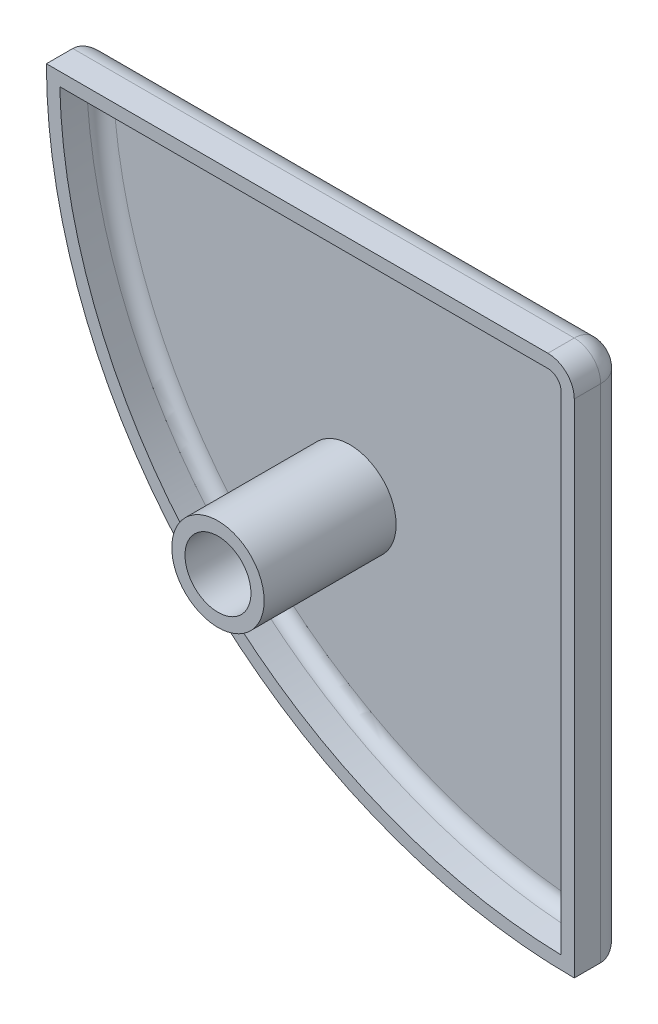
from build123d import *

# Parameters (mm, degrees)
EXTRUDE_1_DEPTH = 2
FILLET_1_R      = 2
SHELL_1_T       = -1
SKETCH_2_R      = 3.5
SKETCH_2_R_2    = 2.5
EXTRUDE_2_DEPTH = 10


with BuildPart() as part:
    # Sketch 1 → Extrude 1 (new, symmetric)
    with BuildSketch(Plane.XY):
        with BuildLine():
            Line((-20, 20), (20, 20))
            Line((20, 20), (20, -20))
            ThreePointArc((20, -20), (-8.284271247, -8.284271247), (-20, 20))
        make_face()
    extrude(amount=EXTRUDE_1_DEPTH, both=True)

    # Fillet 1
    fillet_1_edges = [part.edges().sort_by_distance(p)[0] for p in [
        (0, 20, -2),
        (20, 0, -2),
        (-8.284271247, -8.284271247, -2),
        (20, 20, 0),
    ]]
    fillet(fillet_1_edges, radius=FILLET_1_R)

    # Shell 1
    shell_1_openings = [part.faces().sort_by_distance(p)[0] for p in [
        (3.012173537, 3.012173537, 2),
    ]]
    offset(amount=SHELL_1_T, openings=shell_1_openings)

    # Sketch 2 → Extrude 2 (add)
    with BuildSketch(Plane.XY.offset(-1)):
        Circle(SKETCH_2_R)
        Circle(SKETCH_2_R_2, mode=Mode.SUBTRACT)
    extrude(amount=EXTRUDE_2_DEPTH)


solid = part.part
